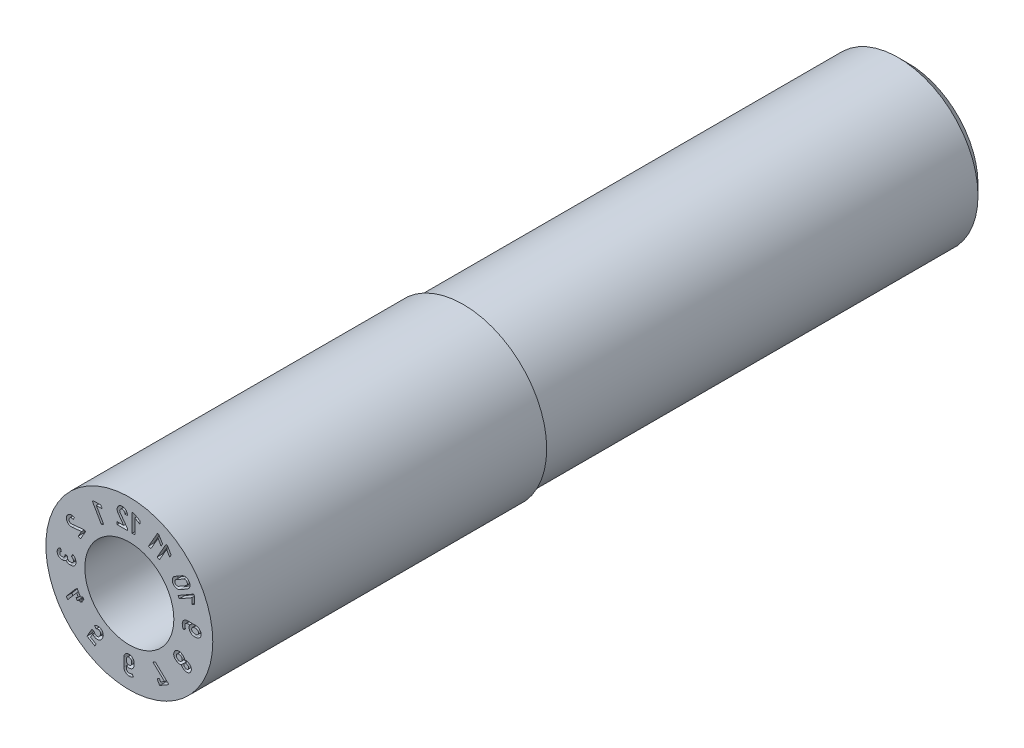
from build123d import *

# Parameters (mm, degrees)
SKETCH5_W          = 8
SKETCH5_H          = 1
CUT_EXTRUDE1_DEPTH = 0.1
CUT_EXTRUDE2_DEPTH = 1.4


with BuildPart() as part:
    # Sketch1 → Revolve1 (revolve)
    with BuildSketch(Plane(origin=(0, 0, 0), x_dir=(0, 0, -1), z_dir=(1, 0, 0)), mode=Mode.PRIVATE) as revolve1_sk:
        Polygon((0, 1.5), (0, 0.8), (2.2, 0.8), (2.2, 0.6), (11, 0.6), (11, 1), (14, 1), (14, 1.25), (13.75, 1.5), align=None)
    revolve(revolve1_sk.sketch.rotate(Axis((0, 0, 3.797909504), (0, 0, -1)), 90), axis=Axis((0, 0, 3.797909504), (0, 0, -1)))

    # Sketch5 → Cut-Revolve1 (revolve, cut)
    with BuildSketch(Plane(origin=(0, 0, 0), x_dir=(0, 0, -1), z_dir=(1, 0, 0)), mode=Mode.PRIVATE) as cut_revolve1_sk:
        with Locations((10, 1.935)):
            Rectangle(SKETCH5_W, SKETCH5_H)
    revolve(cut_revolve1_sk.sketch.rotate(Axis((0, 0, 0), (0, 0, -1)), 90), axis=Axis((0, 0, 0), (0, 0, -1)), mode=Mode.SUBTRACT)

    # Sketch2 → Cut-Extrude1 (cut)
    # profile 1 of 15: a face of its own
    with BuildSketch(Plane.XY):
        Polygon((0.661961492, 1.097771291), (0.688393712, 1.082510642), (0.75120281, 0.974157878), (0.724465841, 0.92784809), (0.6708099, 1.020377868), (0.539831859, 0.793517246), (0.499683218, 0.816697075), align=None)
    # profile 2 of 15: a face of its own
    with BuildSketch(Plane.XY):
        Polygon((0.508297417, 1.192804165), (0.534729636, 1.177543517), (0.597538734, 1.069190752), (0.570801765, 1.022880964), (0.517145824, 1.115410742), (0.386167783, 0.888550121), (0.346019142, 0.911729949), align=None)
    # profile 3 of 15: a face of its own
    with BuildSketch(Plane.XY):
        with BuildLine():
            Line((1.196751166, 0.099277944), (1.043744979, 0.09925198))
            ThreePointArc((1.043744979, 0.09925198), (0.978180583, 0.072090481), (0.951009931, 0.006529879))
            ThreePointArc((0.951009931, 0.006529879), (0.956570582, -0.034375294), (0.972872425, -0.072301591))
            Line((0.972872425, -0.072301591), (1.01268526, -0.048374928))
            ThreePointArc((1.01268526, -0.048374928), (1.000224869, -0.020411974), (0.997513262, 0.010081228))
            ThreePointArc((0.997513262, 0.010081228), (1.012234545, 0.040545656), (1.043736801, 0.052890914))
            Line((1.043736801, 0.052890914), (1.086294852, 0.052887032))
            ThreePointArc((1.086294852, 0.052887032), (1.086107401, -0.039986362), (1.16661391, -0.086291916))
            Line((1.16661391, -0.086291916), (1.196688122, -0.086187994))
            ThreePointArc((1.196688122, -0.086187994), (1.289452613, 0.006513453), (1.196751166, 0.099277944))
        make_face()
        with BuildLine():
            Line((1.196751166, 0.052892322), (1.166619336, 0.052892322))
            ThreePointArc((1.166619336, 0.052892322), (1.120253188, 0.006524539), (1.166622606, -0.039839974))
            Line((1.166622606, -0.039839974), (1.196747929, -0.039839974))
            ThreePointArc((1.196747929, -0.039839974), (1.243115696, 0.006524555), (1.196751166, 0.052892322))
        make_face(mode=Mode.SUBTRACT)
    # profile 4 of 15: a face of its own
    with BuildSketch(Plane.XY):
        Polygon((0.42325035, -0.853637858), (0.465164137, -0.829438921), (0.694859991, -1.045895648), (0.70598579, -1.065166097), (0.54536874, -1.157898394), (0.499002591, -1.077589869), (0.539162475, -1.054403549), (0.562342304, -1.09455219), (0.634612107, -1.0528272), align=None)
    # profile 5 of 15: a face of its own
    with BuildSketch(Plane.XY):
        with BuildLine():
            Line((0.950653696, -0.471927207), (0.936612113, -0.463805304))
            ThreePointArc((0.936612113, -0.463805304), (0.809873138, -0.497710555), (0.843879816, -0.624422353))
            Line((0.843879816, -0.624422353), (0.857923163, -0.632530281))
            ThreePointArc((0.857923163, -0.632530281), (0.896336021, -0.644612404), (0.936248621, -0.63927296))
            ThreePointArc((0.936248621, -0.63927296), (0.950680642, -0.668166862), (0.974991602, -0.68942993))
            Line((0.974991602, -0.68942993), (0.989049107, -0.697532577))
            ThreePointArc((0.989049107, -0.697532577), (1.103021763, -0.666988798), (1.072477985, -0.553016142))
            Line((1.072477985, -0.553016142), (1.058454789, -0.544859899))
            ThreePointArc((1.058454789, -0.544859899), (1.027900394, -0.534377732), (0.995660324, -0.5363839))
            ThreePointArc((0.995660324, -0.5363839), (0.980325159, -0.499150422), (0.950653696, -0.471927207))
        make_face()
        with BuildLine():
            Line((0.998168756, -0.649284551), (1.012226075, -0.657385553))
            ThreePointArc((1.012226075, -0.657385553), (1.062892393, -0.643809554), (1.049316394, -0.593143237))
            Line((1.049316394, -0.593143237), (1.03527206, -0.585019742))
            ThreePointArc((1.03527206, -0.585019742), (0.984536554, -0.59857079), (0.998168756, -0.649284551))
        make_face(mode=Mode.SUBTRACT)
        with BuildLine():
            Line((0.867051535, -0.584272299), (0.88111573, -0.59239227))
            ThreePointArc((0.88111573, -0.59239227), (0.944442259, -0.575416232), (0.927466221, -0.512089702))
            Line((0.927466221, -0.512089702), (0.913424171, -0.503952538))
            ThreePointArc((0.913424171, -0.503952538), (0.850094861, -0.520935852), (0.867051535, -0.584272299))
        make_face(mode=Mode.SUBTRACT)
    # profile 6 of 15: a face of its own
    with BuildSketch(Plane.XY):
        Polygon((1.15544455, 0.569106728), (1.170705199, 0.542674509), (1.170923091, 0.417433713), (1.124613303, 0.390696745), (1.124410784, 0.497657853), (0.897550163, 0.366679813), (0.874370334, 0.406828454), align=None)
    # profile 7 of 15: a face of its own
    with BuildSketch(Plane.XY):
        with BuildLine():
            Line((0.950699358, 0.752841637), (0.818192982, 0.676339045))
            ThreePointArc((0.818192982, 0.676339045), (0.784238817, 0.549644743), (0.910935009, 0.515697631))
            Line((0.910935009, 0.515697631), (1.043444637, 0.592202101))
            ThreePointArc((1.043444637, 0.592202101), (1.077391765, 0.718894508), (0.950699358, 0.752841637))
        make_face()
        with BuildLine():
            Line((0.887748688, 0.555857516), (1.020258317, 0.632361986))
            ThreePointArc((1.020258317, 0.632361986), (1.037227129, 0.695690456), (0.973898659, 0.712659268))
            Line((0.973898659, 0.712659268), (0.841373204, 0.636175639))
            ThreePointArc((0.841373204, 0.636175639), (0.824400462, 0.572828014), (0.887748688, 0.555857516))
        make_face(mode=Mode.SUBTRACT)
    # profile 8 of 15: a face of its own
    with BuildSketch(Plane.XY):
        Polygon((0.052585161, 1.288278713), (0.083106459, 1.288278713), (0.191677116, 1.225847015), (0.191677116, 1.172373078), (0.098944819, 1.225678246), (0.098944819, 0.963722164), (0.052585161, 0.963722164), align=None)
    # profile 9 of 15: a face of its own
    with BuildSketch(Plane.XY):
        with BuildLine():
            Line((-0.218495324, 0.963011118), (-0.03303073, 0.963011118))
            Line((-0.03303073, 0.963011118), (-0.03303073, 0.993675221))
            Line((-0.03303073, 0.993675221), (-0.163411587, 1.174686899))
            ThreePointArc((-0.163411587, 1.174686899), (-0.136658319, 1.246879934), (-0.07992266, 1.19483537))
            Line((-0.07992266, 1.19483537), (-0.033288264, 1.194834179))
            ThreePointArc((-0.033288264, 1.194834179), (-0.150965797, 1.29103519), (-0.2010955, 1.147544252))
            Line((-0.2010955, 1.147544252), (-0.100252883, 1.009383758))
            Line((-0.100252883, 1.009383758), (-0.218495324, 1.009383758))
            Line((-0.218495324, 1.009383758), (-0.218495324, 0.963011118))
        make_face()
    # profile 10 of 15: a face of its own
    with BuildSketch(Plane.XY):
        Polygon((-0.664503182, 1.104892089), (-0.638070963, 1.120152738), (-0.512830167, 1.12037063), (-0.486093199, 1.074060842), (-0.593054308, 1.073858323), (-0.462076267, 0.846997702), (-0.502224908, 0.823817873), align=None)
    # profile 11 of 15: a face of its own
    with BuildSketch(Plane.XY):
        with BuildLine():
            Line((0.08713324, -1.040380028), (0.087237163, -1.070454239))
            ThreePointArc((0.087237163, -1.070454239), (0.040931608, -1.150960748), (-0.051941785, -1.150773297))
            Line((-0.051941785, -1.150773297), (-0.051945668, -1.193331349))
            ThreePointArc((-0.051945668, -1.193331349), (-0.03960041, -1.224833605), (-0.009135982, -1.239554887))
            ThreePointArc((-0.009135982, -1.239554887), (0.021354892, -1.236843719), (0.049315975, -1.224384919))
            Line((0.049315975, -1.224384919), (0.073248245, -1.26420115))
            ThreePointArc((0.073248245, -1.26420115), (0.035321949, -1.280502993), (-0.005583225, -1.286063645))
            ThreePointArc((-0.005583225, -1.286063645), (-0.071143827, -1.258892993), (-0.098305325, -1.193328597))
            Line((-0.098305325, -1.193328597), (-0.098331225, -1.04031672))
            ThreePointArc((-0.098331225, -1.04031672), (-0.005567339, -0.947616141), (0.08713324, -1.040380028))
        make_face()
        with BuildLine():
            Line((-0.051945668, -1.040322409), (-0.051945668, -1.070454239))
            ThreePointArc((-0.051945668, -1.070454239), (-0.005577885, -1.116820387), (0.040786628, -1.070450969))
            Line((0.040786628, -1.070450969), (0.040786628, -1.040325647))
            ThreePointArc((0.040786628, -1.040325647), (-0.005577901, -0.99395788), (-0.051945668, -1.040322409))
        make_face(mode=Mode.SUBTRACT)
    # profile 12 of 15: a face of its own
    with BuildSketch(Plane.XY):
        with BuildLine():
            Line((-0.480552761, -0.929970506), (-0.495647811, -0.956038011))
            ThreePointArc((-0.495647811, -0.956038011), (-0.551953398, -0.999194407), (-0.622297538, -0.990002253))
            ThreePointArc((-0.622297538, -0.990002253), (-0.641590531, -0.976064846), (-0.657599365, -0.958452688))
            Line((-0.657599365, -0.958452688), (-0.697213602, -1.027054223))
            Line((-0.697213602, -1.027054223), (-0.596825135, -1.085013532))
            Line((-0.596825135, -1.085013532), (-0.620011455, -1.125173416))
            Line((-0.620011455, -1.125173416), (-0.760548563, -1.044034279))
            Line((-0.760548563, -1.044034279), (-0.670555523, -0.888161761))
            Line((-0.670555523, -0.888161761), (-0.630406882, -0.91134159))
            ThreePointArc((-0.630406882, -0.91134159), (-0.61830614, -0.933484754), (-0.599106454, -0.949859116))
            ThreePointArc((-0.599106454, -0.949859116), (-0.56392518, -0.954493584), (-0.535780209, -0.932881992))
            Line((-0.535780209, -0.932881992), (-0.520700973, -0.906789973))
            ThreePointArc((-0.520700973, -0.906789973), (-0.516062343, -0.871604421), (-0.537676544, -0.843455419))
            ThreePointArc((-0.537676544, -0.843455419), (-0.568272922, -0.836467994), (-0.597505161, -0.847888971))
            Line((-0.597505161, -0.847888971), (-0.626371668, -0.811555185))
            ThreePointArc((-0.626371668, -0.811555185), (-0.571706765, -0.790181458), (-0.514495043, -0.803292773))
            ThreePointArc((-0.514495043, -0.803292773), (-0.471313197, -0.859608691), (-0.480552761, -0.929970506))
        make_face()
    # profile 13 of 15: a face of its own
    with BuildSketch(Plane.XY):
        with BuildLine():
            Line((-1.213075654, -0.076698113), (-1.196854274, -0.076698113))
            ThreePointArc((-1.196854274, -0.076698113), (-1.165176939, -0.070449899), (-1.138244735, -0.05264119))
            ThreePointArc((-1.138244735, -0.05264119), (-1.106348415, -0.077228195), (-1.067035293, -0.085967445))
            Line((-1.067035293, -0.085967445), (-1.050801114, -0.085967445))
            ThreePointArc((-1.050801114, -0.085967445), (-0.985236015, -0.058806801), (-0.958084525, 0.00676209))
            ThreePointArc((-0.958084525, 0.00676209), (-0.975360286, 0.062844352), (-1.021188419, 0.099497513))
            Line((-1.021188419, 0.099497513), (-1.038200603, 0.056378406))
            ThreePointArc((-1.038200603, 0.056378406), (-1.013683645, 0.036772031), (-1.00444417, 0.006769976))
            ThreePointArc((-1.00444417, 0.006769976), (-1.018024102, -0.02601488), (-1.050808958, -0.039594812))
            Line((-1.050808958, -0.039594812), (-1.067037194, -0.039594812))
            ThreePointArc((-1.067037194, -0.039594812), (-1.099814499, -0.026018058), (-1.113391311, 0.006759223))
            Line((-1.113391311, 0.006759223), (-1.113391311, 0.029938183))
            Line((-1.113391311, 0.029938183), (-1.159763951, 0.029938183))
            Line((-1.159763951, 0.029938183), (-1.159763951, 0.006764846))
            ThreePointArc((-1.159763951, 0.006764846), (-1.170627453, -0.019461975), (-1.196854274, -0.030325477))
            Line((-1.196854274, -0.030325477), (-1.213080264, -0.030325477))
            ThreePointArc((-1.213080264, -0.030325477), (-1.239297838, -0.019452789), (-1.250172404, 0.006764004))
            ThreePointArc((-1.250172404, 0.006764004), (-1.242357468, 0.031099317), (-1.221805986, 0.046295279))
            Line((-1.221805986, 0.046295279), (-1.236644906, 0.090227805))
            ThreePointArc((-1.236644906, 0.090227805), (-1.280011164, 0.058129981), (-1.296539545, 0.006771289))
            ThreePointArc((-1.296539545, 0.006771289), (-1.272099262, -0.052253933), (-1.213075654, -0.076698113))
        make_face()
    # profile 14 of 15: a face of its own
    with BuildSketch(Plane.XY):
        Polygon((-1.1328642, -0.608251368), (-1.108308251, -0.650783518), (-0.948112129, -0.464602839), (-0.918077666, -0.516624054), (-0.958226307, -0.539803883), (-0.935046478, -0.579952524), (-0.894897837, -0.556772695), (-0.883304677, -0.576852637), (-0.843156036, -0.553672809), (-0.854749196, -0.533592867), (-0.814589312, -0.510406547), (-0.837769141, -0.470257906), (-0.877929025, -0.493444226), (-0.935888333, -0.393055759), (-0.959363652, -0.40660924), align=None)
    # profile 15 of 15: a face of its own
    with BuildSketch(Plane.XY):
        with BuildLine():
            Line((-0.917481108, 0.433663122), (-0.877321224, 0.410476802))
            Line((-0.877321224, 0.410476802), (-0.784588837, 0.571094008))
            Line((-0.784588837, 0.571094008), (-0.811144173, 0.586425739))
            Line((-0.811144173, 0.586425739), (-1.033095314, 0.564018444))
            ThreePointArc((-1.033095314, 0.564018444), (-1.082237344, 0.623281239), (-1.00880098, 0.646392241))
            Line((-1.00880098, 0.646392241), (-0.985483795, 0.686780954))
            ThreePointArc((-0.985483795, 0.686780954), (-1.127632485, 0.632969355), (-1.028431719, 0.517812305))
            Line((-1.028431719, 0.517812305), (-0.858359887, 0.53606408))
            Line((-0.858359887, 0.53606408), (-0.917481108, 0.433663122))
        make_face()
    extrude(amount=-CUT_EXTRUDE1_DEPTH, mode=Mode.SUBTRACT)

    # Sketch3 → Cut-Extrude2 (cut)
    with BuildSketch(Plane.XY.offset(-2.2)):
        Polygon((0.346410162, 0.6), (-0.346410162, 0.6), (-0.692820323, 0), (-0.346410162, -0.6), (0.346410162, -0.6), (0.692820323, 0), align=None)
    extrude(amount=-CUT_EXTRUDE2_DEPTH, mode=Mode.SUBTRACT)


solid = part.part
